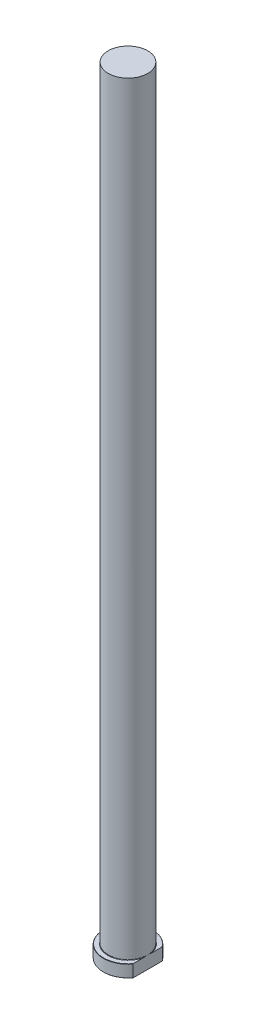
ISO-10303-21;
HEADER;
FILE_DESCRIPTION(('STEP AP214'),'2;1');
FILE_NAME('part.step','',(''),(''),'','','');
FILE_SCHEMA(('AUTOMOTIVE_DESIGN { 1 0 10303 214 1 1 1 1 }'));
ENDSEC;
DATA;
#1=APPLICATION_CONTEXT('core data for automotive mechanical design processes');
#2=APPLICATION_PROTOCOL_DEFINITION('international standard','automotive_design',2000,#1);
#3=PRODUCT_CONTEXT('',#1,'mechanical');
#4=PRODUCT('Part','Part','',(#3));
#5=PRODUCT_RELATED_PRODUCT_CATEGORY('part','',(#4));
#6=PRODUCT_DEFINITION_FORMATION('','',#4);
#7=PRODUCT_DEFINITION_CONTEXT('part definition',#1,'design');
#8=PRODUCT_DEFINITION('design','',#6,#7);
#9=PRODUCT_DEFINITION_SHAPE('','',#8);
#10=(LENGTH_UNIT() NAMED_UNIT(*) SI_UNIT(.MILLI.,.METRE.));
#11=(NAMED_UNIT(*) PLANE_ANGLE_UNIT() SI_UNIT($,.RADIAN.));
#12=(NAMED_UNIT(*) SI_UNIT($,.STERADIAN.) SOLID_ANGLE_UNIT());
#13=UNCERTAINTY_MEASURE_WITH_UNIT(LENGTH_MEASURE(1.E-05),#10,'distance_accuracy_value','');
#14=(GEOMETRIC_REPRESENTATION_CONTEXT(3) GLOBAL_UNCERTAINTY_ASSIGNED_CONTEXT((#13)) GLOBAL_UNIT_ASSIGNED_CONTEXT((#10,
#11,#12)) REPRESENTATION_CONTEXT('',''));
#15=CARTESIAN_POINT('',(0.,0.,0.));
#16=DIRECTION('',(0.,0.,1.));
#17=DIRECTION('',(1.,0.,0.));
#18=AXIS2_PLACEMENT_3D('',#15,#16,#17);
#19=CARTESIAN_POINT('',(0.,0.,0.));
#20=DIRECTION('',(0.,-1.,0.));
#21=DIRECTION('',(0.,0.,-1.));
#22=AXIS2_PLACEMENT_3D('',#19,#20,#21);
#23=PLANE('',#22);
#24=CARTESIAN_POINT('',(0.,0.,0.));
#25=DIRECTION('',(0.,-1.,0.));
#26=DIRECTION('',(0.,0.,-1.));
#27=AXIS2_PLACEMENT_3D('',#24,#25,#26);
#28=CIRCLE('',#27,19.7999999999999);
#29=CARTESIAN_POINT('',(16.,0.,11.6636186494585));
#30=VERTEX_POINT('',#29);
#31=CARTESIAN_POINT('',(16.,0.,-11.6636186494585));
#32=VERTEX_POINT('',#31);
#33=EDGE_CURVE('E98',#30,#32,#28,.T.);
#34=ORIENTED_EDGE('',*,*,#33,.T.);
#35=DIRECTION('',(0.,0.,1.));
#36=VECTOR('',#35,1.);
#37=CARTESIAN_POINT('',(16.,0.,-12.));
#38=LINE('',#37,#36);
#39=EDGE_CURVE('E83',#32,#30,#38,.T.);
#40=ORIENTED_EDGE('',*,*,#39,.T.);
#41=EDGE_LOOP('',(#34,#40));
#42=FACE_BOUND('',#41,.T.);
#43=ADVANCED_FACE('F32',(#42),#23,.T.);
#44=CARTESIAN_POINT('',(0.,259.958771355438,0.));
#45=DIRECTION('',(0.,1.,0.));
#46=DIRECTION('',(0.,0.,1.));
#47=AXIS2_PLACEMENT_3D('',#44,#45,#46);
#48=CYLINDRICAL_SURFACE('',#47,20.);
#49=CARTESIAN_POINT('',(0.,9.79999999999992,0.));
#50=DIRECTION('',(0.,1.,0.));
#51=DIRECTION('',(0.,0.,1.));
#52=AXIS2_PLACEMENT_3D('',#49,#50,#51);
#53=CIRCLE('',#52,20.);
#54=CARTESIAN_POINT('',(16.,9.79999999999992,12.));
#55=VERTEX_POINT('',#54);
#56=CARTESIAN_POINT('',(16.,9.79999999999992,-12.));
#57=VERTEX_POINT('',#56);
#58=EDGE_CURVE('E104',#55,#57,#53,.F.);
#59=ORIENTED_EDGE('',*,*,#58,.T.);
#60=DIRECTION('',(0.,-1.,0.));
#61=VECTOR('',#60,1.);
#62=CARTESIAN_POINT('',(16.,630.,-12.));
#63=LINE('',#62,#61);
#64=CARTESIAN_POINT('',(16.,0.200000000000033,-12.));
#65=VERTEX_POINT('',#64);
#66=EDGE_CURVE('E183',#57,#65,#63,.T.);
#67=ORIENTED_EDGE('',*,*,#66,.T.);
#68=CARTESIAN_POINT('',(0.,0.200000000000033,0.));
#69=DIRECTION('',(0.,-1.,0.));
#70=DIRECTION('',(0.,0.,-1.));
#71=AXIS2_PLACEMENT_3D('',#68,#69,#70);
#72=CIRCLE('',#71,20.);
#73=CARTESIAN_POINT('',(16.,0.200000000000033,12.));
#74=VERTEX_POINT('',#73);
#75=EDGE_CURVE('E100',#65,#74,#72,.F.);
#76=ORIENTED_EDGE('',*,*,#75,.T.);
#77=DIRECTION('',(0.,-1.,0.));
#78=VECTOR('',#77,1.);
#79=CARTESIAN_POINT('',(16.,630.,12.));
#80=LINE('',#79,#78);
#81=EDGE_CURVE('E93',#55,#74,#80,.T.);
#82=ORIENTED_EDGE('',*,*,#81,.F.);
#83=EDGE_LOOP('',(#59,#67,#76,#82));
#84=FACE_BOUND('',#83,.T.);
#85=ADVANCED_FACE('F158',(#84),#48,.T.);
#86=CARTESIAN_POINT('',(-20.,10.,0.));
#87=DIRECTION('',(0.,1.,0.));
#88=DIRECTION('',(0.,0.,1.));
#89=AXIS2_PLACEMENT_3D('',#86,#87,#88);
#90=PLANE('',#89);
#91=CARTESIAN_POINT('',(0.,10.,0.));
#92=DIRECTION('',(0.,1.,0.));
#93=DIRECTION('',(0.,0.,1.));
#94=AXIS2_PLACEMENT_3D('',#91,#92,#93);
#95=CIRCLE('',#94,19.7999999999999);
#96=CARTESIAN_POINT('',(16.,10.,-11.6636186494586));
#97=VERTEX_POINT('',#96);
#98=CARTESIAN_POINT('',(16.,10.,11.6636186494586));
#99=VERTEX_POINT('',#98);
#100=EDGE_CURVE('E178',#97,#99,#95,.T.);
#101=ORIENTED_EDGE('',*,*,#100,.T.);
#102=DIRECTION('',(0.,0.,-1.));
#103=VECTOR('',#102,1.);
#104=CARTESIAN_POINT('',(16.,10.,0.));
#105=LINE('',#104,#103);
#106=CARTESIAN_POINT('',(16.,10.,3.1128764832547));
#107=VERTEX_POINT('',#106);
#108=EDGE_CURVE('E57',#99,#107,#105,.T.);
#109=ORIENTED_EDGE('',*,*,#108,.T.);
#110=CARTESIAN_POINT('',(0.,10.,0.));
#111=DIRECTION('',(0.,1.,0.));
#112=DIRECTION('',(0.,0.,1.));
#113=AXIS2_PLACEMENT_3D('',#110,#111,#112);
#114=CIRCLE('',#113,16.3);
#115=CARTESIAN_POINT('',(16.,10.,-3.11287648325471));
#116=VERTEX_POINT('',#115);
#117=EDGE_CURVE('E107',#107,#116,#114,.F.);
#118=ORIENTED_EDGE('',*,*,#117,.T.);
#119=EDGE_CURVE('E136',#116,#97,#105,.T.);
#120=ORIENTED_EDGE('',*,*,#119,.T.);
#121=EDGE_LOOP('',(#101,#109,#118,#120));
#122=FACE_BOUND('',#121,.T.);
#123=ADVANCED_FACE('F147',(#122),#90,.T.);
#124=CARTESIAN_POINT('',(0.,10.,0.));
#125=DIRECTION('',(0.,-1.,0.));
#126=DIRECTION('',(0.,0.,-1.));
#127=AXIS2_PLACEMENT_3D('',#124,#125,#126);
#128=CONICAL_SURFACE('',#127,19.7999999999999,0.785398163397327);
#129=ORIENTED_EDGE('',*,*,#58,.F.);
#130=CARTESIAN_POINT('',(16.,-1.07064884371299,26.4006999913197));
#131=CARTESIAN_POINT('',(16.,-0.733156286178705,26.0060486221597));
#132=CARTESIAN_POINT('',(16.,-0.396819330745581,25.6104050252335));
#133=CARTESIAN_POINT('',(16.,0.273206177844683,24.8168690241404));
#134=CARTESIAN_POINT('',(16.,0.606894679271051,24.4189765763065));
#135=CARTESIAN_POINT('',(16.,1.27144329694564,23.6204891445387));
#136=CARTESIAN_POINT('',(16.,1.60230187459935,23.2198928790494));
#137=CARTESIAN_POINT('',(16.,2.26059114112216,22.4158945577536));
#138=CARTESIAN_POINT('',(16.,2.58802184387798,22.0124925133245));
#139=CARTESIAN_POINT('',(16.,3.24766747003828,21.1916872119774));
#140=CARTESIAN_POINT('',(16.,3.57977582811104,20.7741982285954));
#141=CARTESIAN_POINT('',(16.,4.23919239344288,19.935447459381));
#142=CARTESIAN_POINT('',(16.,4.56650063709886,19.5141857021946));
#143=CARTESIAN_POINT('',(16.,5.21544461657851,18.6674666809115));
#144=CARTESIAN_POINT('',(16.,5.53708166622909,18.242010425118));
#145=CARTESIAN_POINT('',(16.,6.17378218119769,17.3861997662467));
#146=CARTESIAN_POINT('',(16.,6.48884565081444,16.9558453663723));
#147=CARTESIAN_POINT('',(16.,7.11176935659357,16.0887218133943));
#148=CARTESIAN_POINT('',(16.,7.41961501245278,15.6519421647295));
#149=CARTESIAN_POINT('',(16.,8.02597466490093,14.7719292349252));
#150=CARTESIAN_POINT('',(16.,8.3244885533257,14.3286958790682));
#151=CARTESIAN_POINT('',(16.,8.91052998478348,13.4344389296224));
#152=CARTESIAN_POINT('',(16.,9.19804754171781,12.9834087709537));
#153=CARTESIAN_POINT('',(16.,9.75938980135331,12.0728858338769));
#154=CARTESIAN_POINT('',(16.,10.0332147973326,11.6133932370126));
#155=CARTESIAN_POINT('',(16.,10.5615335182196,10.6892898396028));
#156=CARTESIAN_POINT('',(16.,10.8161891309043,10.2247720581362));
#157=CARTESIAN_POINT('',(16.,11.3053445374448,9.28510847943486));
#158=CARTESIAN_POINT('',(16.,11.5398419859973,8.80996145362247));
#159=CARTESIAN_POINT('',(16.,11.9836278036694,7.84885100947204));
#160=CARTESIAN_POINT('',(16.,12.1929556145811,7.36290596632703));
#161=CARTESIAN_POINT('',(16.,12.5811435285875,6.37912337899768));
#162=CARTESIAN_POINT('',(16.,12.760015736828,5.88129064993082));
#163=CARTESIAN_POINT('',(16.,13.0861366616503,4.85753764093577));
#164=CARTESIAN_POINT('',(16.,13.2321910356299,4.33122827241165));
#165=CARTESIAN_POINT('',(16.,13.4164504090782,3.53379728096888));
#166=CARTESIAN_POINT('',(16.,13.4720698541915,3.2666353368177));
#167=CARTESIAN_POINT('',(16.,13.570901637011,2.73003918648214));
#168=CARTESIAN_POINT('',(16.,13.6141156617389,2.46060529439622));
#169=CARTESIAN_POINT('',(16.,13.6872774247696,1.92117630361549));
#170=CARTESIAN_POINT('',(16.,13.7172841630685,1.65118922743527));
#171=CARTESIAN_POINT('',(16.,13.7638048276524,1.11005042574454));
#172=CARTESIAN_POINT('',(16.,13.7803188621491,0.838898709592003));
#173=CARTESIAN_POINT('',(16.,13.79955866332,0.296109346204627));
#174=CARTESIAN_POINT('',(16.,13.8022847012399,0.024471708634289));
#175=CARTESIAN_POINT('',(16.,13.7939006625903,-0.518588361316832));
#176=CARTESIAN_POINT('',(16.,13.7827905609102,-0.790010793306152));
#177=CARTESIAN_POINT('',(16.,13.7469663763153,-1.33142514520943));
#178=CARTESIAN_POINT('',(16.,13.7222788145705,-1.6014188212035));
#179=CARTESIAN_POINT('',(16.,13.6597540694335,-2.13989179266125));
#180=CARTESIAN_POINT('',(16.,13.6219151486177,-2.4083708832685));
#181=CARTESIAN_POINT('',(16.,13.4895557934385,-3.21066813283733));
#182=CARTESIAN_POINT('',(16.,13.376185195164,-3.74145456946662));
#183=CARTESIAN_POINT('',(16.,13.1048507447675,-4.79469191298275));
#184=CARTESIAN_POINT('',(16.,12.9466209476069,-5.3170728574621));
#185=CARTESIAN_POINT('',(16.,12.6815624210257,-6.09095035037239));
#186=CARTESIAN_POINT('',(16.,12.5885858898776,-6.34730496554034));
#187=CARTESIAN_POINT('',(16.,12.3942381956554,-6.85681818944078));
#188=CARTESIAN_POINT('',(16.,12.2928668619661,-7.10997673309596));
#189=CARTESIAN_POINT('',(16.,11.9087737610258,-8.0289509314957));
#190=CARTESIAN_POINT('',(16.,11.603220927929,-8.68528507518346));
#191=CARTESIAN_POINT('',(16.,10.9520387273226,-9.97785473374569));
#192=CARTESIAN_POINT('',(16.,10.6063845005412,-10.6140774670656));
#193=CARTESIAN_POINT('',(16.,9.88410853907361,-11.8704402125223));
#194=CARTESIAN_POINT('',(16.,9.50742027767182,-12.4905417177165));
#195=CARTESIAN_POINT('',(16.,8.73104614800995,-13.7158784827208));
#196=CARTESIAN_POINT('',(16.,8.33136526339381,-14.3211169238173));
#197=CARTESIAN_POINT('',(16.,7.51225576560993,-15.5221520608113));
#198=CARTESIAN_POINT('',(16.,7.09274396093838,-16.1178917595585));
#199=CARTESIAN_POINT('',(16.,6.23957009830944,-17.2991512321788));
#200=CARTESIAN_POINT('',(16.,5.80590743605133,-17.8846705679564));
#201=CARTESIAN_POINT('',(16.,4.92783508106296,-19.0464967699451));
#202=CARTESIAN_POINT('',(16.,4.48343853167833,-19.6228135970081));
#203=CARTESIAN_POINT('',(16.,3.58557777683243,-20.7683027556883));
#204=CARTESIAN_POINT('',(16.,3.1321138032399,-21.337475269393));
#205=CARTESIAN_POINT('',(16.,2.36744022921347,-22.2844266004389));
#206=CARTESIAN_POINT('',(16.,2.05826684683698,-22.6638539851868));
#207=CARTESIAN_POINT('',(16.,1.43690833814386,-23.420322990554));
#208=CARTESIAN_POINT('',(16.,1.12472279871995,-23.7973642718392));
#209=CARTESIAN_POINT('',(16.,0.499956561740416,-24.5465888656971));
#210=CARTESIAN_POINT('',(16.,0.187394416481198,-24.9187876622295));
#211=CARTESIAN_POINT('',(16.,-0.439990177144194,-25.6611808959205));
#212=CARTESIAN_POINT('',(16.,-0.754812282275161,-26.0313756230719));
#213=CARTESIAN_POINT('',(16.,-1.07064884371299,-26.4006999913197));
#214=B_SPLINE_CURVE_WITH_KNOTS('',3,(#130,#131,#132,#133,#134,#135,#136,#137,#138,#139,#140,
#141,#142,#143,#144,#145,#146,#147,#148,#149,#150,#151,#152,#153,#154,#155,#156,#157,#158,#159,
#160,#161,#162,#163,#164,#165,#166,#167,#168,#169,#170,#171,#172,#173,#174,#175,#176,#177,#178,
#179,#180,#181,#182,#183,#184,#185,#186,#187,#188,#189,#190,#191,#192,#193,#194,#195,#196,#197,
#198,#199,#200,#201,#202,#203,#204,#205,#206,#207,#208,#209,#210,#211,#212,#213),.UNSPECIFIED.,
.F.,.F.,(4,2,2,2,2,2,2,2,2,2,2,2,2,2,2,2,2,2,2,2,2,2,2,2,2,2,2,2,2,2,2,2,2,2,2,2,2,2,2,2,2,4),
(0.,1.55783999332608,3.11571034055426,4.67437978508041,6.23304291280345,7.83343038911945,
9.43380572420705,11.0338053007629,12.6338038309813,14.2367959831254,15.8398067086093,
17.4442401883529,19.0486392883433,20.6374598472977,22.2264650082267,23.8129467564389,
25.3987964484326,27.0353648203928,27.8537926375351,28.6721091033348,29.4867319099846,
30.3013481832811,31.1159484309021,31.9305501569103,32.7435663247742,33.5566899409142,
35.1826128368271,36.8183840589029,37.6363419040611,38.4543163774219,40.6241539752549,
42.7953439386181,44.9713157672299,47.1468177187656,49.3324366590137,51.5181490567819,
53.7013086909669,55.8844125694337,57.3527237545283,58.821239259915,60.2793254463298,
61.7371946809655),.UNSPECIFIED.);
#215=EDGE_CURVE('E135',#55,#99,#214,.T.);
#216=ORIENTED_EDGE('',*,*,#215,.T.);
#217=ORIENTED_EDGE('',*,*,#100,.F.);
#218=EDGE_CURVE('E127',#97,#57,#214,.T.);
#219=ORIENTED_EDGE('',*,*,#218,.T.);
#220=EDGE_LOOP('',(#129,#216,#217,#219));
#221=FACE_BOUND('',#220,.T.);
#222=ADVANCED_FACE('F143',(#221),#128,.T.);
#223=CARTESIAN_POINT('',(0.,0.200000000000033,0.));
#224=DIRECTION('',(0.,1.,0.));
#225=DIRECTION('',(0.,0.,1.));
#226=AXIS2_PLACEMENT_3D('',#223,#224,#225);
#227=CONICAL_SURFACE('',#226,20.,0.785398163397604);
#228=ORIENTED_EDGE('',*,*,#75,.F.);
#229=CARTESIAN_POINT('',(16.,11.0706488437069,-26.4006999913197));
#230=CARTESIAN_POINT('',(16.,10.7331562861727,-26.0060486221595));
#231=CARTESIAN_POINT('',(16.,10.3968193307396,-25.6104050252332));
#232=CARTESIAN_POINT('',(16.,9.72679382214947,-24.8168690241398));
#233=CARTESIAN_POINT('',(16.,9.39310532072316,-24.4189765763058));
#234=CARTESIAN_POINT('',(16.,8.7285567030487,-23.6204891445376));
#235=CARTESIAN_POINT('',(16.,8.39769812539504,-23.2198928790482));
#236=CARTESIAN_POINT('',(16.,7.73940885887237,-22.4158945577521));
#237=CARTESIAN_POINT('',(16.,7.41197815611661,-22.0124925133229));
#238=CARTESIAN_POINT('',(16.,6.75233252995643,-21.1916872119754));
#239=CARTESIAN_POINT('',(16.,6.42022417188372,-20.7741982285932));
#240=CARTESIAN_POINT('',(16.,5.76080760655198,-19.9354474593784));
#241=CARTESIAN_POINT('',(16.,5.43349936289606,-19.5141857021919));
#242=CARTESIAN_POINT('',(16.,4.78455538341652,-18.6674666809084));
#243=CARTESIAN_POINT('',(16.,4.46291833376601,-18.2420104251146));
#244=CARTESIAN_POINT('',(16.,3.82621781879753,-17.386199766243));
#245=CARTESIAN_POINT('',(16.,3.51115434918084,-16.9558453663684));
#246=CARTESIAN_POINT('',(16.,2.88823064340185,-16.08872181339));
#247=CARTESIAN_POINT('',(16.,2.58038498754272,-15.651942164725));
#248=CARTESIAN_POINT('',(16.,1.97402533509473,-14.7719292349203));
#249=CARTESIAN_POINT('',(16.,1.67551144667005,-14.3286958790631));
#250=CARTESIAN_POINT('',(16.,1.08947001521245,-13.4344389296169));
#251=CARTESIAN_POINT('',(16.,0.801952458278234,-12.983408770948));
#252=CARTESIAN_POINT('',(16.,0.240610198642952,-12.0728858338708));
#253=CARTESIAN_POINT('',(16.,-0.0332147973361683,-11.6133932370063));
#254=CARTESIAN_POINT('',(16.,-0.561533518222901,-10.6892898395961));
#255=CARTESIAN_POINT('',(16.,-0.816189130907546,-10.2247720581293));
#256=CARTESIAN_POINT('',(16.,-1.30534453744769,-9.28510847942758));
#257=CARTESIAN_POINT('',(16.,-1.53984198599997,-8.80996145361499));
#258=CARTESIAN_POINT('',(16.,-1.98362780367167,-7.84885100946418));
#259=CARTESIAN_POINT('',(16.,-2.19295561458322,-7.36290596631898));
#260=CARTESIAN_POINT('',(16.,-2.58114352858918,-6.37912337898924));
#261=CARTESIAN_POINT('',(16.,-2.76001573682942,-5.88129064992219));
#262=CARTESIAN_POINT('',(16.,-3.08613666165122,-4.85753764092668));
#263=CARTESIAN_POINT('',(16.,-3.2321910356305,-4.3312282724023));
#264=CARTESIAN_POINT('',(16.,-3.41645040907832,-3.53379728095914));
#265=CARTESIAN_POINT('',(16.,-3.47206985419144,-3.26663533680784));
#266=CARTESIAN_POINT('',(16.,-3.57090163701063,-2.73003918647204));
#267=CARTESIAN_POINT('',(16.,-3.61411566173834,-2.46060529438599));
#268=CARTESIAN_POINT('',(16.,-3.68727742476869,-1.92117630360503));
#269=CARTESIAN_POINT('',(16.,-3.71728416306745,-1.6511892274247));
#270=CARTESIAN_POINT('',(16.,-3.763804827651,-1.11005042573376));
#271=CARTESIAN_POINT('',(16.,-3.7803188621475,-0.838898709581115));
#272=CARTESIAN_POINT('',(16.,-3.79955866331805,-0.296109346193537));
#273=CARTESIAN_POINT('',(16.,-3.80228470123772,-0.0244717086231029));
#274=CARTESIAN_POINT('',(16.,-3.79390066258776,0.5185883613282));
#275=CARTESIAN_POINT('',(16.,-3.78279056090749,0.790010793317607));
#276=CARTESIAN_POINT('',(16.,-3.74696637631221,1.33142514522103));
#277=CARTESIAN_POINT('',(16.,-3.72227881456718,1.60141882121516));
#278=CARTESIAN_POINT('',(16.,-3.65975406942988,2.13989179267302));
#279=CARTESIAN_POINT('',(16.,-3.62191514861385,2.40837088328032));
#280=CARTESIAN_POINT('',(16.,-3.48955579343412,3.21066813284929));
#281=CARTESIAN_POINT('',(16.,-3.37618519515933,3.74145456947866));
#282=CARTESIAN_POINT('',(16.,-3.10485074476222,4.79469191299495));
#283=CARTESIAN_POINT('',(16.,-2.94662094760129,5.31707285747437));
#284=CARTESIAN_POINT('',(16.,-2.68156242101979,6.09095035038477));
#285=CARTESIAN_POINT('',(16.,-2.5885858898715,6.34730496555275));
#286=CARTESIAN_POINT('',(16.,-2.39423819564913,6.85681818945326));
#287=CARTESIAN_POINT('',(16.,-2.29286686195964,7.10997673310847));
#288=CARTESIAN_POINT('',(16.,-1.90877376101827,8.02895093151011));
#289=CARTESIAN_POINT('',(16.,-1.60322092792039,8.68528507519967));
#290=CARTESIAN_POINT('',(16.,-0.952038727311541,9.97785473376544));
#291=CARTESIAN_POINT('',(16.,-0.606384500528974,10.6140774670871));
#292=CARTESIAN_POINT('',(16.,0.115891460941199,11.8704402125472));
#293=CARTESIAN_POINT('',(16.,0.492579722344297,12.490541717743));
#294=CARTESIAN_POINT('',(16.,1.26895385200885,13.7158784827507));
#295=CARTESIAN_POINT('',(16.,1.66863473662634,14.3211169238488));
#296=CARTESIAN_POINT('',(16.,2.48774423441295,15.522152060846));
#297=CARTESIAN_POINT('',(16.,2.90725603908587,16.1178917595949));
#298=CARTESIAN_POINT('',(16.,3.76042990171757,17.2991512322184));
#299=CARTESIAN_POINT('',(16.,4.19409256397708,17.8846705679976));
#300=CARTESIAN_POINT('',(16.,5.07216491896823,19.0464967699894));
#301=CARTESIAN_POINT('',(16.,5.51656146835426,19.622813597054));
#302=CARTESIAN_POINT('',(16.,6.41442222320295,20.7683027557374));
#303=CARTESIAN_POINT('',(16.,6.86788619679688,21.3374752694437));
#304=CARTESIAN_POINT('',(16.,7.63255977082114,22.2844266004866));
#305=CARTESIAN_POINT('',(16.,7.94173315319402,22.66385398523));
#306=CARTESIAN_POINT('',(16.,8.56309166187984,23.4203229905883));
#307=CARTESIAN_POINT('',(16.,8.87527720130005,23.7973642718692));
#308=CARTESIAN_POINT('',(16.,9.50004343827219,24.5465888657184));
#309=CARTESIAN_POINT('',(16.,9.81260558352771,24.9187876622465));
#310=CARTESIAN_POINT('',(16.,10.4399901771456,25.6611808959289));
#311=CARTESIAN_POINT('',(16.,10.7548122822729,26.0313756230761));
#312=CARTESIAN_POINT('',(16.,11.0706488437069,26.4006999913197));
#313=B_SPLINE_CURVE_WITH_KNOTS('',3,(#229,#230,#231,#232,#233,#234,#235,#236,#237,#238,#239,
#240,#241,#242,#243,#244,#245,#246,#247,#248,#249,#250,#251,#252,#253,#254,#255,#256,#257,#258,
#259,#260,#261,#262,#263,#264,#265,#266,#267,#268,#269,#270,#271,#272,#273,#274,#275,#276,#277,
#278,#279,#280,#281,#282,#283,#284,#285,#286,#287,#288,#289,#290,#291,#292,#293,#294,#295,#296,
#297,#298,#299,#300,#301,#302,#303,#304,#305,#306,#307,#308,#309,#310,#311,#312),.UNSPECIFIED.,
.F.,.F.,(4,2,2,2,2,2,2,2,2,2,2,2,2,2,2,2,2,2,2,2,2,2,2,2,2,2,2,2,2,2,2,2,2,2,2,2,2,2,2,2,2,4),
(0.,1.55783999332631,3.11571034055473,4.67437978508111,6.23304291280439,7.83343038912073,
9.43380572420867,11.0338053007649,12.6338038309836,14.236795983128,15.8398067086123,
17.4442401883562,19.048639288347,20.6374598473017,22.226465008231,23.8129467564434,
25.3987964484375,27.0353648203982,27.8537926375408,28.6721091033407,29.4867319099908,
30.3013481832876,31.1159484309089,31.9305501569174,32.7435663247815,33.5566899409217,
35.1826128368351,36.8183840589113,37.6363419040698,38.4543163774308,40.6241539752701,
42.7953439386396,44.9713157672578,47.1468177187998,49.3324366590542,51.5181490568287,
53.7013086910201,55.8844125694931,57.3527237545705,58.82123925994,60.2793254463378,
61.7371946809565),.UNSPECIFIED.);
#314=EDGE_CURVE('E86',#65,#32,#313,.T.);
#315=ORIENTED_EDGE('',*,*,#314,.T.);
#316=ORIENTED_EDGE('',*,*,#33,.F.);
#317=EDGE_CURVE('E89',#30,#74,#313,.T.);
#318=ORIENTED_EDGE('',*,*,#317,.T.);
#319=EDGE_LOOP('',(#228,#315,#316,#318));
#320=FACE_BOUND('',#319,.T.);
#321=ADVANCED_FACE('F97',(#320),#227,.T.);
#322=CARTESIAN_POINT('',(0.,10.3,0.));
#323=DIRECTION('',(0.,1.,0.));
#324=DIRECTION('',(0.,0.,1.));
#325=AXIS2_PLACEMENT_3D('',#322,#323,#324);
#326=TOROIDAL_SURFACE('',#325,16.3,0.3);
#327=CARTESIAN_POINT('',(16.,10.3,0.));
#328=CARTESIAN_POINT('',(16.,10.3000006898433,-5.33715911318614E-09));
#329=CARTESIAN_POINT('',(16.,10.3000013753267,-5.90477996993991E-07));
#330=CARTESIAN_POINT('',(16.,10.3000026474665,-1.99315110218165E-06));
#331=CARTESIAN_POINT('',(16.,10.3000031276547,-2.82387138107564E-06));
#332=CARTESIAN_POINT('',(16.,10.300004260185,-4.93201352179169E-06));
#333=CARTESIAN_POINT('',(16.,10.300004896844,-6.24688723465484E-06));
#334=CARTESIAN_POINT('',(16.,10.3000059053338,-8.79561581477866E-06));
#335=CARTESIAN_POINT('',(16.,10.3000062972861,-1.00244169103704E-05));
#336=CARTESIAN_POINT('',(16.,10.3000079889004,-1.53269558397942E-05));
#337=CARTESIAN_POINT('',(16.,10.3000092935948,-1.94146126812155E-05));
#338=CARTESIAN_POINT('',(16.,10.3000111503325,-2.70530674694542E-05));
#339=CARTESIAN_POINT('',(16.,10.300011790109,-3.05834546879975E-05));
#340=CARTESIAN_POINT('',(16.,10.3000164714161,-5.69924666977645E-05));
#341=CARTESIAN_POINT('',(16.,10.3000199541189,-7.99464318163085E-05));
#342=CARTESIAN_POINT('',(16.,10.3000322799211,-0.000171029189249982));
#343=CARTESIAN_POINT('',(16.,10.3000382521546,-0.000239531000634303));
#344=CARTESIAN_POINT('',(16.,10.3000656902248,-0.00050618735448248));
#345=CARTESIAN_POINT('',(16.,10.3000950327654,-0.0007033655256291));
#346=CARTESIAN_POINT('',(16.,10.3002038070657,-0.0014556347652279));
#347=CARTESIAN_POINT('',(16.,10.300277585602,-0.00201139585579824));
#348=CARTESIAN_POINT('',(16.,10.3005644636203,-0.00414914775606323));
#349=CARTESIAN_POINT('',(16.,10.300783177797,-0.00573048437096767));
#350=CARTESIAN_POINT('',(16.,10.3018172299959,-0.0132287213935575));
#351=CARTESIAN_POINT('',(16.,10.3026243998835,-0.0191465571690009));
#352=CARTESIAN_POINT('',(16.,10.3110865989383,-0.0811528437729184));
#353=CARTESIAN_POINT('',(16.,10.3187815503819,-0.137236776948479));
#354=CARTESIAN_POINT('',(16.,10.3348868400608,-0.255096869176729));
#355=CARTESIAN_POINT('',(16.,10.343290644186,-0.316873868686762));
#356=CARTESIAN_POINT('',(16.,10.3571569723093,-0.419331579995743));
#357=CARTESIAN_POINT('',(16.,10.3626434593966,-0.460008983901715));
#358=CARTESIAN_POINT('',(16.,10.3734224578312,-0.540334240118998));
#359=CARTESIAN_POINT('',(16.,10.3787163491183,-0.579981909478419));
#360=CARTESIAN_POINT('',(16.,10.4083966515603,-0.803619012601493));
#361=CARTESIAN_POINT('',(16.,10.4321379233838,-0.987696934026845));
#362=CARTESIAN_POINT('',(16.,10.4771585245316,-1.35808125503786));
#363=CARTESIAN_POINT('',(16.,10.4984099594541,-1.54439106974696));
#364=CARTESIAN_POINT('',(16.,10.5392977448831,-1.94430528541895));
#365=CARTESIAN_POINT('',(16.,10.5582626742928,-2.15798298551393));
#366=CARTESIAN_POINT('',(16.,10.5798230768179,-2.47853128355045));
#367=CARTESIAN_POINT('',(16.,10.5858566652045,-2.58516682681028));
#368=CARTESIAN_POINT('',(16.,10.5950189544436,-2.79855398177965));
#369=CARTESIAN_POINT('',(16.,10.5981480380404,-2.90530557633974));
#370=CARTESIAN_POINT('',(16.,10.6006064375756,-3.11480969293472));
#371=CARTESIAN_POINT('',(16.,10.600075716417,-3.21755992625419));
#372=CARTESIAN_POINT('',(16.,10.5957602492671,-3.37181907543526));
#373=CARTESIAN_POINT('',(16.,10.593726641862,-3.42337702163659));
#374=CARTESIAN_POINT('',(16.,10.5882429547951,-3.52640582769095));
#375=CARTESIAN_POINT('',(16.,10.584793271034,-3.57787670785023));
#376=CARTESIAN_POINT('',(16.,10.5763123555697,-3.67890194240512));
#377=CARTESIAN_POINT('',(16.,10.5713398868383,-3.72846106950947));
#378=CARTESIAN_POINT('',(16.,10.5593485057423,-3.82738811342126));
#379=CARTESIAN_POINT('',(16.,10.5523274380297,-3.87675577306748));
#380=CARTESIAN_POINT('',(16.,10.5356271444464,-3.97473922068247));
#381=CARTESIAN_POINT('',(16.,10.5259654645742,-4.02335780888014));
#382=CARTESIAN_POINT('',(16.,10.5085240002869,-4.09553189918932));
#383=CARTESIAN_POINT('',(16.,10.5022253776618,-4.11944402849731));
#384=CARTESIAN_POINT('',(16.,10.4883597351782,-4.16689390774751));
#385=CARTESIAN_POINT('',(16.,10.4807934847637,-4.19043187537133));
#386=CARTESIAN_POINT('',(16.,10.468072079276,-4.22548932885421));
#387=CARTESIAN_POINT('',(16.,10.463554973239,-4.23724015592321));
#388=CARTESIAN_POINT('',(16.,10.4539723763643,-4.2605292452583));
#389=CARTESIAN_POINT('',(16.,10.4489064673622,-4.27206733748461));
#390=CARTESIAN_POINT('',(16.,10.4380905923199,-4.29485009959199));
#391=CARTESIAN_POINT('',(16.,10.4323392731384,-4.30609413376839));
#392=CARTESIAN_POINT('',(16.,10.4199753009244,-4.32809262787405));
#393=CARTESIAN_POINT('',(16.,10.4133636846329,-4.33884765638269));
#394=CARTESIAN_POINT('',(16.,10.3989169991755,-4.35969720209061));
#395=CARTESIAN_POINT('',(16.,10.3910687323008,-4.36978269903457));
#396=CARTESIAN_POINT('',(16.,10.3737930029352,-4.38847604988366));
#397=CARTESIAN_POINT('',(16.,10.3643793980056,-4.39709563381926));
#398=CARTESIAN_POINT('',(16.,10.349684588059,-4.40721260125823));
#399=CARTESIAN_POINT('',(16.,10.3452411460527,-4.40991204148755));
#400=CARTESIAN_POINT('',(16.,10.3360120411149,-4.41465735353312));
#401=CARTESIAN_POINT('',(16.,10.331226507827,-4.41670347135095));
#402=CARTESIAN_POINT('',(16.,10.321316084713,-4.41997867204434));
#403=CARTESIAN_POINT('',(16.,10.3161880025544,-4.42119837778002));
#404=CARTESIAN_POINT('',(16.,10.3057936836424,-4.42262740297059));
#405=CARTESIAN_POINT('',(16.,10.3005276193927,-4.42283792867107));
#406=CARTESIAN_POINT('',(16.,10.2906214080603,-4.42225569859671));
#407=CARTESIAN_POINT('',(16.,10.285974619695,-4.42156796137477));
#408=CARTESIAN_POINT('',(16.,10.2768560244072,-4.41944337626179));
#409=CARTESIAN_POINT('',(16.,10.2723843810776,-4.41800584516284));
#410=CARTESIAN_POINT('',(16.,10.2619701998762,-4.41381248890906));
#411=CARTESIAN_POINT('',(16.,10.2561483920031,-4.4107598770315));
#412=CARTESIAN_POINT('',(16.,10.2450526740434,-4.40378684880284));
#413=CARTESIAN_POINT('',(16.,10.239780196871,-4.39986424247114));
#414=CARTESIAN_POINT('',(16.,10.2257729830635,-4.38808908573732));
#415=CARTESIAN_POINT('',(16.,10.2175965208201,-4.37958133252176));
#416=CARTESIAN_POINT('',(16.,10.2024790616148,-4.36154434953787));
#417=CARTESIAN_POINT('',(16.,10.1955419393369,-4.35201206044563));
#418=CARTESIAN_POINT('',(16.,10.1791886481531,-4.32717029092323));
#419=CARTESIAN_POINT('',(16.,10.1703884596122,-4.31145991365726));
#420=CARTESIAN_POINT('',(16.,10.154248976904,-4.2792945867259));
#421=CARTESIAN_POINT('',(16.,10.1469131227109,-4.26283799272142));
#422=CARTESIAN_POINT('',(16.,10.1332947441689,-4.22939871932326));
#423=CARTESIAN_POINT('',(16.,10.1270179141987,-4.2124137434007));
#424=CARTESIAN_POINT('',(16.,10.1153239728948,-4.17817736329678));
#425=CARTESIAN_POINT('',(16.,10.1099058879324,-4.16092628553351));
#426=CARTESIAN_POINT('',(16.,10.0949674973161,-4.10989946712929));
#427=CARTESIAN_POINT('',(16.,10.0863847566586,-4.07584989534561));
#428=CARTESIAN_POINT('',(16.,10.0710343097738,-4.00733871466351));
#429=CARTESIAN_POINT('',(16.,10.0642677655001,-3.97287685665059));
#430=CARTESIAN_POINT('',(16.,10.0460186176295,-3.86898411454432));
#431=CARTESIAN_POINT('',(16.,10.036623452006,-3.79918851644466));
#432=CARTESIAN_POINT('',(16.,10.0215249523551,-3.65915321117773));
#433=CARTESIAN_POINT('',(16.,10.0158261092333,-3.58891306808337));
#434=CARTESIAN_POINT('',(16.,10.0072116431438,-3.44836432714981));
#435=CARTESIAN_POINT('',(16.,10.00429218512,-3.37805595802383));
#436=CARTESIAN_POINT('',(16.,10.000668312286,-3.23904020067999));
#437=CARTESIAN_POINT('',(16.,9.99991350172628,-3.17033397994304));
#438=CARTESIAN_POINT('',(16.,10.0001018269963,-3.03292208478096));
#439=CARTESIAN_POINT('',(16.,10.0010450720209,-2.96421641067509));
#440=CARTESIAN_POINT('',(16.,10.0059904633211,-2.75810886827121));
#441=CARTESIAN_POINT('',(16.,10.0121089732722,-2.62075798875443));
#442=CARTESIAN_POINT('',(16.,10.0284391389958,-2.34612718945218));
#443=CARTESIAN_POINT('',(16.,10.0386564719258,-2.20884763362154));
#444=CARTESIAN_POINT('',(16.,10.0621466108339,-1.93454208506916));
#445=CARTESIAN_POINT('',(16.,10.075419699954,-1.79751611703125));
#446=CARTESIAN_POINT('',(16.,10.118522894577,-1.38740066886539));
#447=CARTESIAN_POINT('',(16.,10.1516806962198,-1.11466812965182));
#448=CARTESIAN_POINT('',(16.,10.2220528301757,-0.569702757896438));
#449=CARTESIAN_POINT('',(16.,10.259267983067,-0.297470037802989));
#450=CARTESIAN_POINT('',(16.,10.2965515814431,-0.0251841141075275));
#451=CARTESIAN_POINT('',(16.,10.2965597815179,-0.0251242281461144));
#452=CARTESIAN_POINT('',(16.,10.2972621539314,-0.019994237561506));
#453=CARTESIAN_POINT('',(16.,10.2979507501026,-0.0149234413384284));
#454=CARTESIAN_POINT('',(16.,10.2989595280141,-0.00761717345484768));
#455=CARTESIAN_POINT('',(16.,10.2992705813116,-0.00538056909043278));
#456=CARTESIAN_POINT('',(16.,10.2996656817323,-0.00242425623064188));
#457=CARTESIAN_POINT('',(16.,10.2997604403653,-0.00170587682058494));
#458=CARTESIAN_POINT('',(16.,10.2998960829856,-0.000765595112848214));
#459=CARTESIAN_POINT('',(16.,10.2999290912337,-0.000542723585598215));
#460=CARTESIAN_POINT('',(16.,10.2999593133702,-0.000246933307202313));
#461=CARTESIAN_POINT('',(16.,10.2999656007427,-0.000175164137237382));
#462=CARTESIAN_POINT('',(16.,10.2999790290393,-8.05668880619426E-05));
#463=CARTESIAN_POINT('',(16.,10.2999827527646,-5.72823548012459E-05));
#464=CARTESIAN_POINT('',(16.,10.2999877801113,-3.05492734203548E-05));
#465=CARTESIAN_POINT('',(16.,10.2999884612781,-2.70084595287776E-05));
#466=CARTESIAN_POINT('',(16.,10.2999904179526,-1.93523012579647E-05));
#467=CARTESIAN_POINT('',(16.,10.2999917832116,-1.52589672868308E-05));
#468=CARTESIAN_POINT('',(16.,10.2999935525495,-9.95362422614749E-06));
#469=CARTESIAN_POINT('',(16.,10.2999939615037,-8.72734435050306E-06));
#470=CARTESIAN_POINT('',(16.,10.2999950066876,-6.18658496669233E-06));
#471=CARTESIAN_POINT('',(16.,10.2999956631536,-4.87748836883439E-06));
#472=CARTESIAN_POINT('',(16.,10.2999968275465,-2.7813010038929E-06));
#473=CARTESIAN_POINT('',(16.,10.2999973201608,-1.95628425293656E-06));
#474=CARTESIAN_POINT('',(16.,10.2999986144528,-5.7037197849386E-07));
#475=CARTESIAN_POINT('',(16.,10.299999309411,5.3429283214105E-09));
#476=CARTESIAN_POINT('',(16.,10.3,0.));
#477=B_SPLINE_CURVE_WITH_KNOTS('',3,(#327,#328,#329,#330,#331,#332,#333,#334,#335,#336,#337,
#338,#339,#340,#341,#342,#343,#344,#345,#346,#347,#348,#349,#350,#351,#352,#353,#354,#355,#356,
#357,#358,#359,#360,#361,#362,#363,#364,#365,#366,#367,#368,#369,#370,#371,#372,#373,#374,#375,
#376,#377,#378,#379,#380,#381,#382,#383,#384,#385,#386,#387,#388,#389,#390,#391,#392,#393,#394,
#395,#396,#397,#398,#399,#400,#401,#402,#403,#404,#405,#406,#407,#408,#409,#410,#411,#412,#413,
#414,#415,#416,#417,#418,#419,#420,#421,#422,#423,#424,#425,#426,#427,#428,#429,#430,#431,#432,
#433,#434,#435,#436,#437,#438,#439,#440,#441,#442,#443,#444,#445,#446,#447,#448,#449,#450,#451,
#452,#453,#454,#455,#456,#457,#458,#459,#460,#461,#462,#463,#464,#465,#466,#467,#468,#469,#470,
#471,#472,#473,#474,#475,#476),.UNSPECIFIED.,.T.,.F.,(4,2,2,2,2,2,2,2,2,2,2,2,2,2,2,2,2,2,2,2,2,
2,2,2,2,2,2,2,2,2,2,2,2,2,2,2,2,2,2,2,2,2,2,2,2,2,2,2,2,2,2,2,2,2,2,2,2,2,2,2,2,2,2,2,2,2,2,2,2,
2,2,2,2,2,4),(0.,2.26177734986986E-06,5.26667807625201E-06,9.57510831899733E-06,
1.34525317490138E-05,2.62880070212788E-05,3.70424186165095E-05,0.00010669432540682,
0.000312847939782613,0.00091073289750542,0.00259276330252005,0.00738178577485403,
0.0252998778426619,0.195126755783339,0.382165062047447,0.505302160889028,0.625300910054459,
1.18209491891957,1.74462724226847,2.38803172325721,2.7084197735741,3.02876559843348,
3.33693017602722,3.49170918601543,3.64644495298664,3.79583437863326,3.94538154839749,
4.09395822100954,4.16811893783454,4.24223480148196,4.27999202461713,4.31777822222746,
4.35564029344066,4.39345715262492,4.43170898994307,4.4696386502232,4.485195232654,
4.50074595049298,4.51647028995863,4.53217582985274,4.54619960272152,4.56023617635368,
4.5798446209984,4.59950299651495,4.63470321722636,4.67001163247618,4.72389684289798,
4.77790718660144,4.83219927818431,4.88642936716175,4.99169124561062,5.09702030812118,
5.30811846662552,5.51947262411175,5.73053472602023,5.93664148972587,6.14276150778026,
6.55512598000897,6.96806358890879,7.38103947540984,8.20517107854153,9.0294696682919,
9.02965100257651,9.04500321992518,9.05177741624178,9.05395133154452,9.05462709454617,
9.05484306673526,9.05491380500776,9.05492461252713,9.05493751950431,9.05494140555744,
9.05494572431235,9.05494873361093,9.05495099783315),.UNSPECIFIED.);
#478=CARTESIAN_POINT('',(16.,10.3,0.));
#479=VERTEX_POINT('',#478);
#480=EDGE_CURVE('E11',#116,#479,#477,.T.);
#481=ORIENTED_EDGE('',*,*,#480,.F.);
#482=ORIENTED_EDGE('',*,*,#117,.F.);
#483=CARTESIAN_POINT('',(16.,10.3,0.));
#484=CARTESIAN_POINT('',(16.,10.2999993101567,5.33715953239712E-09));
#485=CARTESIAN_POINT('',(16.,10.2999986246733,5.90477997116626E-07));
#486=CARTESIAN_POINT('',(16.,10.2999973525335,1.99315110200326E-06));
#487=CARTESIAN_POINT('',(16.,10.2999968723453,2.82387138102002E-06));
#488=CARTESIAN_POINT('',(16.,10.299995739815,4.93201352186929E-06));
#489=CARTESIAN_POINT('',(16.,10.299995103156,6.24688723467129E-06));
#490=CARTESIAN_POINT('',(16.,10.2999940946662,8.7956158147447E-06));
#491=CARTESIAN_POINT('',(16.,10.2999937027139,1.00244169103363E-05));
#492=CARTESIAN_POINT('',(16.,10.2999920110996,1.53269558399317E-05));
#493=CARTESIAN_POINT('',(16.,10.2999907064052,1.94146126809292E-05));
#494=CARTESIAN_POINT('',(16.,10.2999888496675,2.70530674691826E-05));
#495=CARTESIAN_POINT('',(16.,10.299988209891,3.05834546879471E-05));
#496=CARTESIAN_POINT('',(16.,10.2999835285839,5.69924666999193E-05));
#497=CARTESIAN_POINT('',(16.,10.2999800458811,7.99464318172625E-05));
#498=CARTESIAN_POINT('',(15.9999999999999,10.2999677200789,0.000171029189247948));
#499=CARTESIAN_POINT('',(16.,10.2999617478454,0.000239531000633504));
#500=CARTESIAN_POINT('',(16.,10.2999343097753,0.000506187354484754));
#501=CARTESIAN_POINT('',(16.,10.2999049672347,0.000703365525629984));
#502=CARTESIAN_POINT('',(15.9999999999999,10.2997961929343,0.00145563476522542));
#503=CARTESIAN_POINT('',(16.,10.299722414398,0.00201139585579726));
#504=CARTESIAN_POINT('',(16.,10.2994355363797,0.004149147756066));
#505=CARTESIAN_POINT('',(16.,10.299216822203,0.00573048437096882));
#506=CARTESIAN_POINT('',(15.9999999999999,10.2981827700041,0.0132287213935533));
#507=CARTESIAN_POINT('',(15.9999999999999,10.2973756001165,0.0191465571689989));
#508=CARTESIAN_POINT('',(16.0000000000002,10.2889134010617,0.0811528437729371));
#509=CARTESIAN_POINT('',(16.,10.2812184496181,0.137236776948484));
#510=CARTESIAN_POINT('',(15.9999999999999,10.2651131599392,0.255096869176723));
#511=CARTESIAN_POINT('',(16.,10.256709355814,0.316873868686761));
#512=CARTESIAN_POINT('',(16.,10.2428430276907,0.419331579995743));
#513=CARTESIAN_POINT('',(16.,10.2373565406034,0.460008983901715));
#514=CARTESIAN_POINT('',(16.,10.2265775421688,0.540334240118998));
#515=CARTESIAN_POINT('',(16.,10.2212836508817,0.579981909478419));
#516=CARTESIAN_POINT('',(16.,10.1916033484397,0.803619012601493));
#517=CARTESIAN_POINT('',(16.,10.1678620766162,0.987696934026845));
#518=CARTESIAN_POINT('',(16.,10.1228414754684,1.35808125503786));
#519=CARTESIAN_POINT('',(16.,10.101590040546,1.54439106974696));
#520=CARTESIAN_POINT('',(16.,10.0607022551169,1.94430528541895));
#521=CARTESIAN_POINT('',(16.,10.0417373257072,2.15798298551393));
#522=CARTESIAN_POINT('',(16.,10.0201769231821,2.47853128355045));
#523=CARTESIAN_POINT('',(16.,10.0141433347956,2.58516682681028));
#524=CARTESIAN_POINT('',(16.,10.0049810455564,2.79855398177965));
#525=CARTESIAN_POINT('',(16.,10.0018519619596,2.90530557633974));
#526=CARTESIAN_POINT('',(16.,9.9993935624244,3.11480969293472));
#527=CARTESIAN_POINT('',(16.,9.99992428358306,3.21755992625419));
#528=CARTESIAN_POINT('',(16.,10.0042397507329,3.37181907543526));
#529=CARTESIAN_POINT('',(16.,10.006273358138,3.42337702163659));
#530=CARTESIAN_POINT('',(16.,10.0117570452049,3.52640582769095));
#531=CARTESIAN_POINT('',(16.,10.015206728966,3.57787670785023));
#532=CARTESIAN_POINT('',(16.,10.0236876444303,3.67890194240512));
#533=CARTESIAN_POINT('',(16.,10.0286601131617,3.72846106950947));
#534=CARTESIAN_POINT('',(16.,10.0406514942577,3.82738811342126));
#535=CARTESIAN_POINT('',(16.,10.0476725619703,3.87675577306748));
#536=CARTESIAN_POINT('',(16.,10.0643728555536,3.97473922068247));
#537=CARTESIAN_POINT('',(16.,10.0740345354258,4.02335780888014));
#538=CARTESIAN_POINT('',(16.,10.0914759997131,4.09553189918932));
#539=CARTESIAN_POINT('',(16.,10.0977746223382,4.11944402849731));
#540=CARTESIAN_POINT('',(16.,10.1116402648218,4.16689390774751));
#541=CARTESIAN_POINT('',(16.,10.1192065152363,4.19043187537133));
#542=CARTESIAN_POINT('',(16.,10.1319279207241,4.22548932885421));
#543=CARTESIAN_POINT('',(16.,10.136445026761,4.23724015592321));
#544=CARTESIAN_POINT('',(16.,10.1460276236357,4.2605292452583));
#545=CARTESIAN_POINT('',(16.,10.1510935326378,4.27206733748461));
#546=CARTESIAN_POINT('',(16.,10.1619094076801,4.29485009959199));
#547=CARTESIAN_POINT('',(16.,10.1676607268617,4.30609413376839));
#548=CARTESIAN_POINT('',(16.,10.1800246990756,4.32809262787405));
#549=CARTESIAN_POINT('',(16.,10.1866363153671,4.33884765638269));
#550=CARTESIAN_POINT('',(16.,10.2010830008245,4.35969720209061));
#551=CARTESIAN_POINT('',(16.,10.2089312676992,4.36978269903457));
#552=CARTESIAN_POINT('',(16.,10.2262069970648,4.38847604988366));
#553=CARTESIAN_POINT('',(16.,10.2356206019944,4.39709563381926));
#554=CARTESIAN_POINT('',(16.,10.250315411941,4.40721260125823));
#555=CARTESIAN_POINT('',(16.,10.2547588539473,4.40991204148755));
#556=CARTESIAN_POINT('',(16.,10.2639879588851,4.41465735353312));
#557=CARTESIAN_POINT('',(16.,10.268773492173,4.41670347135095));
#558=CARTESIAN_POINT('',(16.,10.278683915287,4.41997867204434));
#559=CARTESIAN_POINT('',(16.,10.2838119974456,4.42119837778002));
#560=CARTESIAN_POINT('',(16.,10.2942063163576,4.42262740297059));
#561=CARTESIAN_POINT('',(16.,10.2994723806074,4.42283792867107));
#562=CARTESIAN_POINT('',(16.,10.3093785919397,4.42225569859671));
#563=CARTESIAN_POINT('',(16.,10.314025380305,4.42156796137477));
#564=CARTESIAN_POINT('',(16.,10.3231439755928,4.41944337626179));
#565=CARTESIAN_POINT('',(16.,10.3276156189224,4.41800584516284));
#566=CARTESIAN_POINT('',(16.,10.3380298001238,4.41381248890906));
#567=CARTESIAN_POINT('',(16.,10.3438516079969,4.4107598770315));
#568=CARTESIAN_POINT('',(16.,10.3549473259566,4.40378684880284));
#569=CARTESIAN_POINT('',(16.,10.360219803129,4.39986424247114));
#570=CARTESIAN_POINT('',(16.,10.3742270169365,4.38808908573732));
#571=CARTESIAN_POINT('',(16.,10.3824034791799,4.37958133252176));
#572=CARTESIAN_POINT('',(16.,10.3975209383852,4.36154434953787));
#573=CARTESIAN_POINT('',(16.,10.4044580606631,4.35201206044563));
#574=CARTESIAN_POINT('',(16.,10.420811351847,4.32717029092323));
#575=CARTESIAN_POINT('',(16.,10.4296115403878,4.31145991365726));
#576=CARTESIAN_POINT('',(16.,10.445751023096,4.2792945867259));
#577=CARTESIAN_POINT('',(16.,10.4530868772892,4.26283799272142));
#578=CARTESIAN_POINT('',(16.,10.4667052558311,4.22939871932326));
#579=CARTESIAN_POINT('',(16.,10.4729820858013,4.2124137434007));
#580=CARTESIAN_POINT('',(16.,10.4846760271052,4.17817736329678));
#581=CARTESIAN_POINT('',(16.,10.4900941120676,4.16092628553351));
#582=CARTESIAN_POINT('',(16.,10.505032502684,4.10989946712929));
#583=CARTESIAN_POINT('',(16.,10.5136152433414,4.07584989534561));
#584=CARTESIAN_POINT('',(16.,10.5289656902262,4.00733871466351));
#585=CARTESIAN_POINT('',(16.,10.5357322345,3.97287685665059));
#586=CARTESIAN_POINT('',(16.,10.5539813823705,3.86898411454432));
#587=CARTESIAN_POINT('',(16.,10.563376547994,3.79918851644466));
#588=CARTESIAN_POINT('',(16.,10.5784750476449,3.65915321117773));
#589=CARTESIAN_POINT('',(16.,10.5841738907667,3.58891306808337));
#590=CARTESIAN_POINT('',(16.,10.5927883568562,3.44836432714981));
#591=CARTESIAN_POINT('',(16.,10.59570781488,3.37805595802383));
#592=CARTESIAN_POINT('',(16.,10.599331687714,3.23904020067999));
#593=CARTESIAN_POINT('',(16.,10.6000864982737,3.17033397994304));
#594=CARTESIAN_POINT('',(16.,10.5998981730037,3.03292208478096));
#595=CARTESIAN_POINT('',(16.,10.5989549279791,2.96421641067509));
#596=CARTESIAN_POINT('',(16.,10.5940095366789,2.75810886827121));
#597=CARTESIAN_POINT('',(16.,10.5878910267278,2.62075798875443));
#598=CARTESIAN_POINT('',(16.,10.5715608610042,2.34612718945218));
#599=CARTESIAN_POINT('',(16.,10.5613435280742,2.20884763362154));
#600=CARTESIAN_POINT('',(16.,10.5378533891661,1.93454208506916));
#601=CARTESIAN_POINT('',(16.,10.5245803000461,1.79751611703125));
#602=CARTESIAN_POINT('',(16.,10.481477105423,1.38740066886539));
#603=CARTESIAN_POINT('',(16.,10.4483193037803,1.11466812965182));
#604=CARTESIAN_POINT('',(16.,10.3779471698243,0.569702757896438));
#605=CARTESIAN_POINT('',(16.,10.340732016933,0.297470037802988));
#606=CARTESIAN_POINT('',(16.,10.3034484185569,0.0251841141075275));
#607=CARTESIAN_POINT('',(16.,10.3034402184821,0.0251242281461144));
#608=CARTESIAN_POINT('',(16.,10.3027378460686,0.019994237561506));
#609=CARTESIAN_POINT('',(16.,10.3020492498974,0.0149234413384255));
#610=CARTESIAN_POINT('',(16.,10.3010404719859,0.00761717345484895));
#611=CARTESIAN_POINT('',(16.,10.3007294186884,0.00538056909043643));
#612=CARTESIAN_POINT('',(16.,10.3003343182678,0.0024242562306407));
#613=CARTESIAN_POINT('',(16.,10.3002395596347,0.00170587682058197));
#614=CARTESIAN_POINT('',(16.,10.3001039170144,0.000765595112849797));
#615=CARTESIAN_POINT('',(16.,10.3000709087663,0.000542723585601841));
#616=CARTESIAN_POINT('',(16.,10.3000406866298,0.000246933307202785));
#617=CARTESIAN_POINT('',(16.,10.3000343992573,0.000175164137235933));
#618=CARTESIAN_POINT('',(16.,10.3000209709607,8.05668880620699E-05));
#619=CARTESIAN_POINT('',(16.,10.3000172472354,5.72823548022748E-05));
#620=CARTESIAN_POINT('',(16.,10.3000122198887,3.05492734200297E-05));
#621=CARTESIAN_POINT('',(16.,10.3000115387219,2.70084595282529E-05));
#622=CARTESIAN_POINT('',(16.,10.3000095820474,1.93523012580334E-05));
#623=CARTESIAN_POINT('',(16.,10.3000082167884,1.52589672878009E-05));
#624=CARTESIAN_POINT('',(16.,10.3000064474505,9.9536242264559E-06));
#625=CARTESIAN_POINT('',(16.,10.3000060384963,8.7273443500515E-06));
#626=CARTESIAN_POINT('',(16.,10.3000049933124,6.18658496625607E-06));
#627=CARTESIAN_POINT('',(16.,10.3000043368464,4.87748836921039E-06));
#628=CARTESIAN_POINT('',(16.,10.3000031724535,2.78130100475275E-06));
#629=CARTESIAN_POINT('',(16.,10.3000026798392,1.95628425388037E-06));
#630=CARTESIAN_POINT('',(16.,10.3000013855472,5.70371978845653E-07));
#631=CARTESIAN_POINT('',(16.,10.300000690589,-5.34292874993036E-09));
#632=CARTESIAN_POINT('',(16.,10.3,0.));
#633=B_SPLINE_CURVE_WITH_KNOTS('',3,(#483,#484,#485,#486,#487,#488,#489,#490,#491,#492,#493,
#494,#495,#496,#497,#498,#499,#500,#501,#502,#503,#504,#505,#506,#507,#508,#509,#510,#511,#512,
#513,#514,#515,#516,#517,#518,#519,#520,#521,#522,#523,#524,#525,#526,#527,#528,#529,#530,#531,
#532,#533,#534,#535,#536,#537,#538,#539,#540,#541,#542,#543,#544,#545,#546,#547,#548,#549,#550,
#551,#552,#553,#554,#555,#556,#557,#558,#559,#560,#561,#562,#563,#564,#565,#566,#567,#568,#569,
#570,#571,#572,#573,#574,#575,#576,#577,#578,#579,#580,#581,#582,#583,#584,#585,#586,#587,#588,
#589,#590,#591,#592,#593,#594,#595,#596,#597,#598,#599,#600,#601,#602,#603,#604,#605,#606,#607,
#608,#609,#610,#611,#612,#613,#614,#615,#616,#617,#618,#619,#620,#621,#622,#623,#624,#625,#626,
#627,#628,#629,#630,#631,#632),.UNSPECIFIED.,.T.,.F.,(4,2,2,2,2,2,2,2,2,2,2,2,2,2,2,2,2,2,2,2,2,
2,2,2,2,2,2,2,2,2,2,2,2,2,2,2,2,2,2,2,2,2,2,2,2,2,2,2,2,2,2,2,2,2,2,2,2,2,2,2,2,2,2,2,2,2,2,2,2,
2,2,2,2,2,4),(0.,2.26177734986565E-06,5.26667807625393E-06,9.57510831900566E-06,
1.34525317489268E-05,2.62880070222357E-05,3.70424186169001E-05,0.000106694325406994,
0.000312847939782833,0.00091073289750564,0.00259276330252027,0.00738178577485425,
0.0252998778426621,0.195126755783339,0.382165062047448,0.505302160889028,0.625300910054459,
1.18209491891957,1.74462724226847,2.38803172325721,2.7084197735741,3.02876559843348,
3.33693017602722,3.49170918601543,3.64644495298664,3.79583437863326,3.94538154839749,
4.09395822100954,4.16811893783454,4.24223480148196,4.27999202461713,4.31777822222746,
4.35564029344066,4.39345715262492,4.43170898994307,4.4696386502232,4.485195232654,
4.50074595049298,4.51647028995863,4.53217582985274,4.54619960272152,4.56023617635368,
4.5798446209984,4.59950299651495,4.63470321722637,4.67001163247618,4.72389684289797,
4.77790718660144,4.83219927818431,4.88642936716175,4.99169124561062,5.09702030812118,
5.30811846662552,5.51947262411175,5.73053472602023,5.93664148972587,6.14276150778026,
6.55512598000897,6.96806358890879,7.38103947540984,8.20517107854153,9.0294696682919,
9.02965100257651,9.04500321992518,9.05177741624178,9.05395133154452,9.05462709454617,
9.05484306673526,9.05491380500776,9.05492461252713,9.05493751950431,9.05494140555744,
9.05494572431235,9.05494873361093,9.05495099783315),.UNSPECIFIED.);
#634=EDGE_CURVE('E46',#479,#107,#633,.T.);
#635=ORIENTED_EDGE('',*,*,#634,.F.);
#636=CARTESIAN_POINT('',(0.,10.3,0.));
#637=DIRECTION('',(0.,1.,0.));
#638=DIRECTION('',(0.,0.,1.));
#639=AXIS2_PLACEMENT_3D('',#636,#637,#638);
#640=CIRCLE('',#639,16.);
#641=EDGE_CURVE('E103',#479,#479,#640,.T.);
#642=ORIENTED_EDGE('',*,*,#641,.F.);
#643=EDGE_LOOP('',(#481,#482,#635,#642));
#644=FACE_BOUND('',#643,.T.);
#645=ADVANCED_FACE('F34',(#644),#326,.F.);
#646=CARTESIAN_POINT('',(0.,259.958771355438,0.));
#647=DIRECTION('',(0.,1.,0.));
#648=DIRECTION('',(0.,0.,1.));
#649=AXIS2_PLACEMENT_3D('',#646,#647,#648);
#650=CYLINDRICAL_SURFACE('',#649,16.);
#651=ORIENTED_EDGE('',*,*,#641,.T.);
#652=EDGE_LOOP('',(#651));
#653=FACE_BOUND('',#652,.T.);
#654=CARTESIAN_POINT('',(0.,630.,0.));
#655=DIRECTION('',(0.,1.,0.));
#656=DIRECTION('',(0.,0.,1.));
#657=AXIS2_PLACEMENT_3D('',#654,#655,#656);
#658=CIRCLE('',#657,16.);
#659=CARTESIAN_POINT('',(0.,630.,16.));
#660=VERTEX_POINT('',#659);
#661=EDGE_CURVE('E101',#660,#660,#658,.T.);
#662=ORIENTED_EDGE('',*,*,#661,.F.);
#663=EDGE_LOOP('',(#662));
#664=FACE_BOUND('',#663,.T.);
#665=ADVANCED_FACE('F155',(#653,#664),#650,.T.);
#666=CARTESIAN_POINT('',(-16.,630.,0.));
#667=DIRECTION('',(0.,1.,0.));
#668=DIRECTION('',(0.,0.,1.));
#669=AXIS2_PLACEMENT_3D('',#666,#667,#668);
#670=PLANE('',#669);
#671=ORIENTED_EDGE('',*,*,#661,.T.);
#672=EDGE_LOOP('',(#671));
#673=FACE_BOUND('',#672,.T.);
#674=ADVANCED_FACE('F121',(#673),#670,.T.);
#675=CARTESIAN_POINT('',(16.,630.,-12.));
#676=DIRECTION('',(1.,0.,0.));
#677=DIRECTION('',(0.,0.,-1.));
#678=AXIS2_PLACEMENT_3D('',#675,#676,#677);
#679=PLANE('',#678);
#680=ORIENTED_EDGE('',*,*,#66,.F.);
#681=ORIENTED_EDGE('',*,*,#218,.F.);
#682=ORIENTED_EDGE('',*,*,#119,.F.);
#683=ORIENTED_EDGE('',*,*,#480,.T.);
#684=ORIENTED_EDGE('',*,*,#634,.T.);
#685=ORIENTED_EDGE('',*,*,#108,.F.);
#686=ORIENTED_EDGE('',*,*,#215,.F.);
#687=ORIENTED_EDGE('',*,*,#81,.T.);
#688=ORIENTED_EDGE('',*,*,#317,.F.);
#689=ORIENTED_EDGE('',*,*,#39,.F.);
#690=ORIENTED_EDGE('',*,*,#314,.F.);
#691=EDGE_LOOP('',(#680,#681,#682,#683,#684,#685,#686,#687,#688,#689,#690));
#692=FACE_BOUND('',#691,.T.);
#693=ADVANCED_FACE('F85',(#692),#679,.T.);
#694=CLOSED_SHELL('',(#43,#85,#123,#222,#321,#645,#665,#674,#693));
#695=MANIFOLD_SOLID_BREP('B2',#694);
#696=ADVANCED_BREP_SHAPE_REPRESENTATION('',(#18,#695),#14);
#697=SHAPE_DEFINITION_REPRESENTATION(#9,#696);
ENDSEC;
END-ISO-10303-21;
